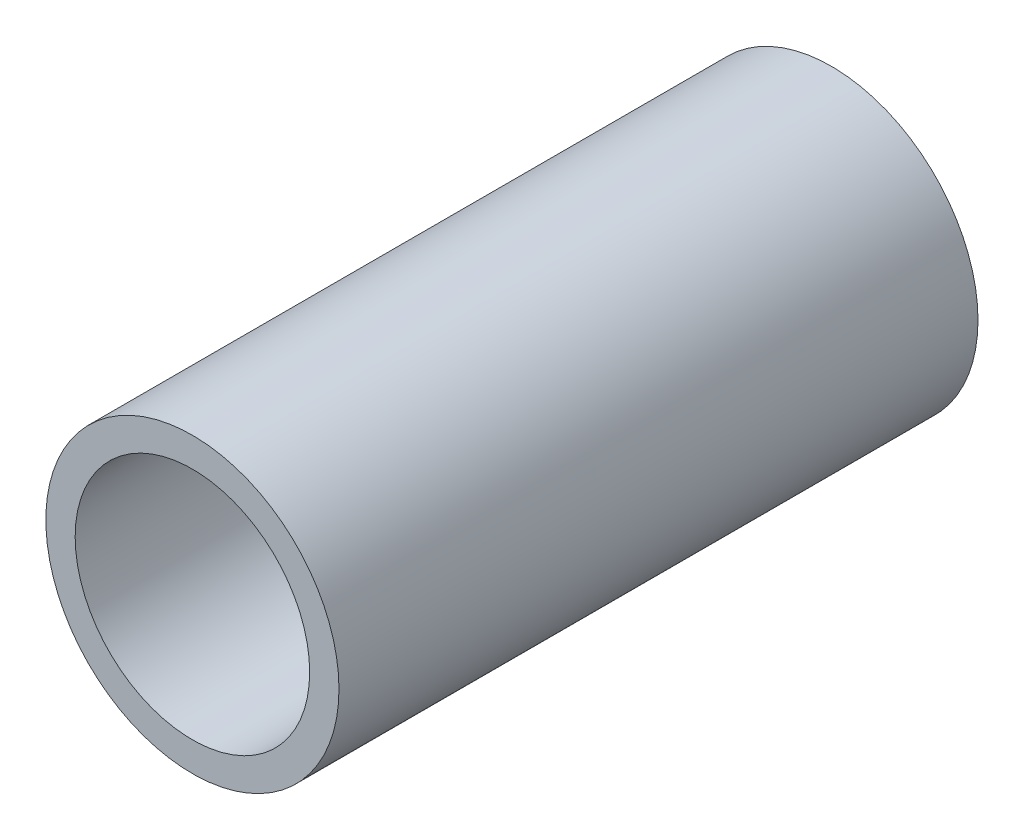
ISO-10303-21;
HEADER;
FILE_DESCRIPTION(('STEP AP214'),'2;1');
FILE_NAME('part.step','',(''),(''),'','','');
FILE_SCHEMA(('AUTOMOTIVE_DESIGN { 1 0 10303 214 1 1 1 1 }'));
ENDSEC;
DATA;
#1=APPLICATION_CONTEXT('core data for automotive mechanical design processes');
#2=APPLICATION_PROTOCOL_DEFINITION('international standard','automotive_design',2000,#1);
#3=PRODUCT_CONTEXT('',#1,'mechanical');
#4=PRODUCT('Part','Part','',(#3));
#5=PRODUCT_RELATED_PRODUCT_CATEGORY('part','',(#4));
#6=PRODUCT_DEFINITION_FORMATION('','',#4);
#7=PRODUCT_DEFINITION_CONTEXT('part definition',#1,'design');
#8=PRODUCT_DEFINITION('design','',#6,#7);
#9=PRODUCT_DEFINITION_SHAPE('','',#8);
#10=(LENGTH_UNIT() NAMED_UNIT(*) SI_UNIT(.MILLI.,.METRE.));
#11=(NAMED_UNIT(*) PLANE_ANGLE_UNIT() SI_UNIT($,.RADIAN.));
#12=(NAMED_UNIT(*) SI_UNIT($,.STERADIAN.) SOLID_ANGLE_UNIT());
#13=UNCERTAINTY_MEASURE_WITH_UNIT(LENGTH_MEASURE(1.E-05),#10,'distance_accuracy_value','');
#14=(GEOMETRIC_REPRESENTATION_CONTEXT(3) GLOBAL_UNCERTAINTY_ASSIGNED_CONTEXT((#13)) GLOBAL_UNIT_ASSIGNED_CONTEXT((#10,
#11,#12)) REPRESENTATION_CONTEXT('',''));
#15=CARTESIAN_POINT('',(0.,0.,0.));
#16=DIRECTION('',(0.,0.,1.));
#17=DIRECTION('',(1.,0.,0.));
#18=AXIS2_PLACEMENT_3D('',#15,#16,#17);
#19=CARTESIAN_POINT('',(0.,0.,109.));
#20=DIRECTION('',(0.,0.,1.));
#21=DIRECTION('',(1.,0.,0.));
#22=AXIS2_PLACEMENT_3D('',#19,#20,#21);
#23=PLANE('',#22);
#24=CARTESIAN_POINT('',(0.,0.,109.));
#25=DIRECTION('',(0.,0.,1.));
#26=DIRECTION('',(1.,0.,0.));
#27=AXIS2_PLACEMENT_3D('',#24,#25,#26);
#28=CIRCLE('',#27,25.);
#29=CARTESIAN_POINT('',(25.,0.,109.));
#30=VERTEX_POINT('',#29);
#31=EDGE_CURVE('E11',#30,#30,#28,.T.);
#32=ORIENTED_EDGE('',*,*,#31,.T.);
#33=EDGE_LOOP('',(#32));
#34=FACE_BOUND('',#33,.T.);
#35=CARTESIAN_POINT('',(0.,0.,109.));
#36=DIRECTION('',(0.,0.,1.));
#37=DIRECTION('',(1.,0.,0.));
#38=AXIS2_PLACEMENT_3D('',#35,#36,#37);
#39=CIRCLE('',#38,20.);
#40=CARTESIAN_POINT('',(20.,0.,109.));
#41=VERTEX_POINT('',#40);
#42=EDGE_CURVE('E369',#41,#41,#39,.T.);
#43=ORIENTED_EDGE('',*,*,#42,.F.);
#44=EDGE_LOOP('',(#43));
#45=FACE_BOUND('',#44,.T.);
#46=ADVANCED_FACE('F358',(#34,#45),#23,.T.);
#47=CARTESIAN_POINT('',(0.,0.,0.));
#48=DIRECTION('',(0.,0.,1.));
#49=DIRECTION('',(1.,0.,0.));
#50=AXIS2_PLACEMENT_3D('',#47,#48,#49);
#51=PLANE('',#50);
#52=CARTESIAN_POINT('',(0.,0.,0.));
#53=DIRECTION('',(0.,0.,1.));
#54=DIRECTION('',(1.,0.,0.));
#55=AXIS2_PLACEMENT_3D('',#52,#53,#54);
#56=CIRCLE('',#55,25.);
#57=CARTESIAN_POINT('',(25.,0.,0.));
#58=VERTEX_POINT('',#57);
#59=EDGE_CURVE('E365',#58,#58,#56,.T.);
#60=ORIENTED_EDGE('',*,*,#59,.F.);
#61=EDGE_LOOP('',(#60));
#62=FACE_BOUND('',#61,.T.);
#63=CARTESIAN_POINT('',(0.,0.,0.));
#64=DIRECTION('',(0.,0.,1.));
#65=DIRECTION('',(1.,0.,0.));
#66=AXIS2_PLACEMENT_3D('',#63,#64,#65);
#67=CIRCLE('',#66,20.);
#68=CARTESIAN_POINT('',(20.,0.,0.));
#69=VERTEX_POINT('',#68);
#70=EDGE_CURVE('E373',#69,#69,#67,.T.);
#71=ORIENTED_EDGE('',*,*,#70,.T.);
#72=EDGE_LOOP('',(#71));
#73=FACE_BOUND('',#72,.T.);
#74=ADVANCED_FACE('F379',(#62,#73),#51,.F.);
#75=CARTESIAN_POINT('',(0.,0.,109.));
#76=DIRECTION('',(0.,0.,-1.));
#77=DIRECTION('',(-1.,0.,0.));
#78=AXIS2_PLACEMENT_3D('',#75,#76,#77);
#79=CYLINDRICAL_SURFACE('',#78,25.);
#80=ORIENTED_EDGE('',*,*,#31,.F.);
#81=EDGE_LOOP('',(#80));
#82=FACE_BOUND('',#81,.T.);
#83=ORIENTED_EDGE('',*,*,#59,.T.);
#84=EDGE_LOOP('',(#83));
#85=FACE_BOUND('',#84,.T.);
#86=ADVANCED_FACE('F360',(#82,#85),#79,.T.);
#87=CARTESIAN_POINT('',(0.,0.,109.));
#88=DIRECTION('',(0.,0.,-1.));
#89=DIRECTION('',(-1.,0.,0.));
#90=AXIS2_PLACEMENT_3D('',#87,#88,#89);
#91=CYLINDRICAL_SURFACE('',#90,20.);
#92=ORIENTED_EDGE('',*,*,#42,.T.);
#93=EDGE_LOOP('',(#92));
#94=FACE_BOUND('',#93,.T.);
#95=ORIENTED_EDGE('',*,*,#70,.F.);
#96=EDGE_LOOP('',(#95));
#97=FACE_BOUND('',#96,.T.);
#98=ADVANCED_FACE('F381',(#94,#97),#91,.F.);
#99=CLOSED_SHELL('',(#46,#74,#86,#98));
#100=MANIFOLD_SOLID_BREP('B2',#99);
#101=ADVANCED_BREP_SHAPE_REPRESENTATION('',(#18,#100),#14);
#102=SHAPE_DEFINITION_REPRESENTATION(#9,#101);
ENDSEC;
END-ISO-10303-21;
